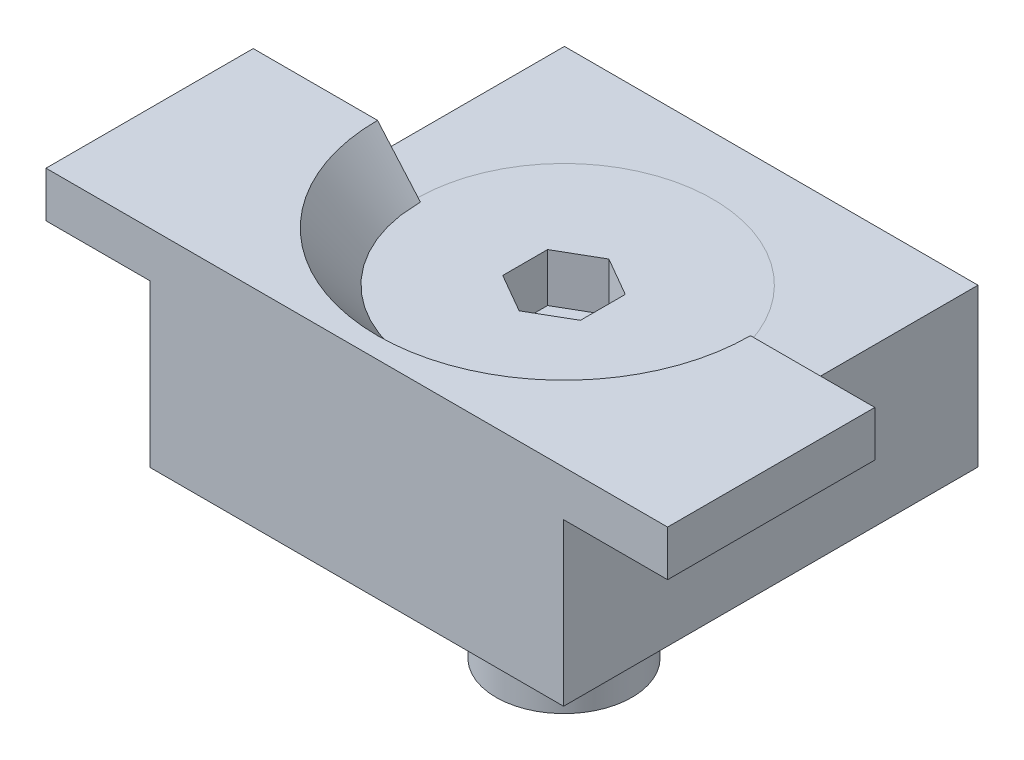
ISO-10303-21;
HEADER;
FILE_DESCRIPTION(('STEP AP214'),'2;1');
FILE_NAME('part.step','',(''),(''),'','','');
FILE_SCHEMA(('AUTOMOTIVE_DESIGN { 1 0 10303 214 1 1 1 1 }'));
ENDSEC;
DATA;
#1=APPLICATION_CONTEXT('core data for automotive mechanical design processes');
#2=APPLICATION_PROTOCOL_DEFINITION('international standard','automotive_design',2000,#1);
#3=PRODUCT_CONTEXT('',#1,'mechanical');
#4=PRODUCT('Part','Part','',(#3));
#5=PRODUCT_RELATED_PRODUCT_CATEGORY('part','',(#4));
#6=PRODUCT_DEFINITION_FORMATION('','',#4);
#7=PRODUCT_DEFINITION_CONTEXT('part definition',#1,'design');
#8=PRODUCT_DEFINITION('design','',#6,#7);
#9=PRODUCT_DEFINITION_SHAPE('','',#8);
#10=(LENGTH_UNIT() NAMED_UNIT(*) SI_UNIT(.MILLI.,.METRE.));
#11=(NAMED_UNIT(*) PLANE_ANGLE_UNIT() SI_UNIT($,.RADIAN.));
#12=(NAMED_UNIT(*) SI_UNIT($,.STERADIAN.) SOLID_ANGLE_UNIT());
#13=UNCERTAINTY_MEASURE_WITH_UNIT(LENGTH_MEASURE(1.E-05),#10,'distance_accuracy_value','');
#14=(GEOMETRIC_REPRESENTATION_CONTEXT(3) GLOBAL_UNCERTAINTY_ASSIGNED_CONTEXT((#13)) GLOBAL_UNIT_ASSIGNED_CONTEXT((#10,
#11,#12)) REPRESENTATION_CONTEXT('',''));
#15=CARTESIAN_POINT('',(0.,0.,0.));
#16=DIRECTION('',(0.,0.,1.));
#17=DIRECTION('',(1.,0.,0.));
#18=AXIS2_PLACEMENT_3D('',#15,#16,#17);
#19=CARTESIAN_POINT('',(9.52499999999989,30.2387,6.35000000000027));
#20=DIRECTION('',(0.,0.999999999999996,0.));
#21=DIRECTION('',(0.,0.,0.999999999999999));
#22=AXIS2_PLACEMENT_3D('',#19,#20,#21);
#23=CYLINDRICAL_SURFACE('',#22,2.08280000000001);
#24=CARTESIAN_POINT('',(9.52499999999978,-5.06729999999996,6.35000000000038));
#25=DIRECTION('',(0.,0.999999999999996,0.));
#26=DIRECTION('',(0.,0.,0.999999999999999));
#27=AXIS2_PLACEMENT_3D('',#24,#25,#26);
#28=CIRCLE('',#27,2.08280000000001);
#29=CARTESIAN_POINT('',(9.52499999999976,-5.06729999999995,8.43280000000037));
#30=VERTEX_POINT('',#29);
#31=EDGE_CURVE('P0_E11',#30,#30,#28,.F.);
#32=CARTESIAN_POINT('',(9.52499999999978,1.98981263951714,6.35000000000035));
#33=DIRECTION('',(0.,0.999999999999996,0.));
#34=DIRECTION('',(0.,0.,0.999999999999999));
#35=AXIS2_PLACEMENT_3D('',#32,#33,#34);
#36=CIRCLE('',#35,2.0828);
#37=CARTESIAN_POINT('',(9.52499999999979,1.98981263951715,8.43280000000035));
#38=VERTEX_POINT('',#37);
#39=EDGE_CURVE('P0_E119',#38,#38,#36,.T.);
#40=CARTESIAN_POINT('',(9.52499999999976,-5.06729999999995,8.43280000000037));
#41=CARTESIAN_POINT('',(9.52499999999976,-4.99378841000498,8.43280000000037));
#42=CARTESIAN_POINT('',(9.52499999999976,-4.92027682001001,8.43280000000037));
#43=CARTESIAN_POINT('',(9.52499999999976,-4.77325364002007,8.43280000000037));
#44=CARTESIAN_POINT('',(9.52499999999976,-4.6997420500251,8.43280000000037));
#45=CARTESIAN_POINT('',(9.52499999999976,-4.55271887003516,8.43280000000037));
#46=CARTESIAN_POINT('',(9.52499999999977,-4.47920728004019,8.43280000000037));
#47=CARTESIAN_POINT('',(9.52499999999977,-4.33218410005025,8.43280000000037));
#48=CARTESIAN_POINT('',(9.52499999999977,-4.25867251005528,8.43280000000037));
#49=CARTESIAN_POINT('',(9.52499999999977,-4.11164933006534,8.43280000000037));
#50=CARTESIAN_POINT('',(9.52499999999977,-4.03813774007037,8.43280000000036));
#51=CARTESIAN_POINT('',(9.52499999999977,-3.89111456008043,8.43280000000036));
#52=CARTESIAN_POINT('',(9.52499999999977,-3.81760297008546,8.43280000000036));
#53=CARTESIAN_POINT('',(9.52499999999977,-3.67057979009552,8.43280000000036));
#54=CARTESIAN_POINT('',(9.52499999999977,-3.59706820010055,8.43280000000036));
#55=CARTESIAN_POINT('',(9.52499999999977,-3.45004502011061,8.43280000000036));
#56=CARTESIAN_POINT('',(9.52499999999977,-3.37653343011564,8.43280000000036));
#57=CARTESIAN_POINT('',(9.52499999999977,-3.22951025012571,8.43280000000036));
#58=CARTESIAN_POINT('',(9.52499999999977,-3.15599866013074,8.43280000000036));
#59=CARTESIAN_POINT('',(9.52499999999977,-3.0089754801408,8.43280000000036));
#60=CARTESIAN_POINT('',(9.52499999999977,-2.93546389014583,8.43280000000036));
#61=CARTESIAN_POINT('',(9.52499999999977,-2.78844071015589,8.43280000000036));
#62=CARTESIAN_POINT('',(9.52499999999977,-2.71492912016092,8.43280000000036));
#63=CARTESIAN_POINT('',(9.52499999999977,-2.56790594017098,8.43280000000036));
#64=CARTESIAN_POINT('',(9.52499999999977,-2.49439435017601,8.43280000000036));
#65=CARTESIAN_POINT('',(9.52499999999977,-2.34737117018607,8.43280000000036));
#66=CARTESIAN_POINT('',(9.52499999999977,-2.2738595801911,8.43280000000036));
#67=CARTESIAN_POINT('',(9.52499999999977,-2.12683640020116,8.43280000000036));
#68=CARTESIAN_POINT('',(9.52499999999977,-2.05332481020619,8.43280000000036));
#69=CARTESIAN_POINT('',(9.52499999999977,-1.90630163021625,8.43280000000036));
#70=CARTESIAN_POINT('',(9.52499999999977,-1.83279004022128,8.43280000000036));
#71=CARTESIAN_POINT('',(9.52499999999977,-1.68576686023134,8.43280000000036));
#72=CARTESIAN_POINT('',(9.52499999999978,-1.61225527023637,8.43280000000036));
#73=CARTESIAN_POINT('',(9.52499999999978,-1.46523209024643,8.43280000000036));
#74=CARTESIAN_POINT('',(9.52499999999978,-1.39172050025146,8.43280000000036));
#75=CARTESIAN_POINT('',(9.52499999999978,-1.24469732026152,8.43280000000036));
#76=CARTESIAN_POINT('',(9.52499999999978,-1.17118573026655,8.43280000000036));
#77=CARTESIAN_POINT('',(9.52499999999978,-1.02416255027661,8.43280000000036));
#78=CARTESIAN_POINT('',(9.52499999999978,-0.950650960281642,8.43280000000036));
#79=CARTESIAN_POINT('',(9.52499999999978,-0.803627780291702,8.43280000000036));
#80=CARTESIAN_POINT('',(9.52499999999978,-0.730116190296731,8.43280000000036));
#81=CARTESIAN_POINT('',(9.52499999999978,-0.583093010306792,8.43280000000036));
#82=CARTESIAN_POINT('',(9.52499999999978,-0.509581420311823,8.43280000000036));
#83=CARTESIAN_POINT('',(9.52499999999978,-0.362558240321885,8.43280000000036));
#84=CARTESIAN_POINT('',(9.52499999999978,-0.289046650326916,8.43280000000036));
#85=CARTESIAN_POINT('',(9.52499999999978,-0.142023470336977,8.43280000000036));
#86=CARTESIAN_POINT('',(9.52499999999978,-0.0685118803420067,8.43280000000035));
#87=CARTESIAN_POINT('',(9.52499999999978,0.0785112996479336,8.43280000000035));
#88=CARTESIAN_POINT('',(9.52499999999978,0.152022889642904,8.43280000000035));
#89=CARTESIAN_POINT('',(9.52499999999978,0.299046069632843,8.43280000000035));
#90=CARTESIAN_POINT('',(9.52499999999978,0.372557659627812,8.43280000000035));
#91=CARTESIAN_POINT('',(9.52499999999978,0.519580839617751,8.43280000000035));
#92=CARTESIAN_POINT('',(9.52499999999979,0.593092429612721,8.43280000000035));
#93=CARTESIAN_POINT('',(9.52499999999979,0.740115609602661,8.43280000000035));
#94=CARTESIAN_POINT('',(9.52499999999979,0.81362719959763,8.43280000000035));
#95=CARTESIAN_POINT('',(9.52499999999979,0.960650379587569,8.43280000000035));
#96=CARTESIAN_POINT('',(9.52499999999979,1.03416196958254,8.43280000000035));
#97=CARTESIAN_POINT('',(9.52499999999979,1.18118514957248,8.43280000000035));
#98=CARTESIAN_POINT('',(9.52499999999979,1.25469673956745,8.43280000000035));
#99=CARTESIAN_POINT('',(9.52499999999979,1.40171991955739,8.43280000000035));
#100=CARTESIAN_POINT('',(9.52499999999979,1.47523150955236,8.43280000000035));
#101=CARTESIAN_POINT('',(9.52499999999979,1.6222546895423,8.43280000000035));
#102=CARTESIAN_POINT('',(9.52499999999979,1.69576627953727,8.43280000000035));
#103=CARTESIAN_POINT('',(9.52499999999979,1.84278945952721,8.43280000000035));
#104=CARTESIAN_POINT('',(9.52499999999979,1.91630104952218,8.43280000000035));
#105=CARTESIAN_POINT('',(9.52499999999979,1.98981263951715,8.43280000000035));
#106=B_SPLINE_CURVE_WITH_KNOTS('',3,(#40,#41,#42,#43,#44,#45,#46,#47,#48,#49,#50,#51,#52,#53,
#54,#55,#56,#57,#58,#59,#60,#61,#62,#63,#64,#65,#66,#67,#68,#69,#70,#71,#72,#73,#74,#75,#76,#77,
#78,#79,#80,#81,#82,#83,#84,#85,#86,#87,#88,#89,#90,#91,#92,#93,#94,#95,#96,#97,#98,#99,#100,
#101,#102,#103,#104,#105),.UNSPECIFIED.,.F.,.F.,(4,2,2,2,2,2,2,2,2,2,2,2,2,2,2,2,2,2,2,2,2,2,2,
2,2,2,2,2,2,2,2,2,4),(0.,0.220534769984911,0.441069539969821,0.661604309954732,
0.882139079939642,1.10267384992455,1.32320861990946,1.54374338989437,1.76427815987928,
1.98481292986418,2.20534769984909,2.425882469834,2.64641723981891,2.86695200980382,
3.08748677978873,3.30802154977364,3.52855631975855,3.74909108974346,3.96962585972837,
4.19016062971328,4.41069539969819,4.6312301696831,4.851764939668,5.07229970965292,
5.29283447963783,5.51336924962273,5.73390401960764,5.95443878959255,6.17497355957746,
6.39550832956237,6.61604309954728,6.83657786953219,7.0571126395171),.UNSPECIFIED.);
#107=EDGE_CURVE('P0_BSEAM16',#30,#38,#106,.T.);
#108=ORIENTED_EDGE('',*,*,#31,.F.);
#109=ORIENTED_EDGE('',*,*,#39,.F.);
#110=ORIENTED_EDGE('',*,*,#107,.T.);
#111=ORIENTED_EDGE('',*,*,#107,.F.);
#112=EDGE_LOOP('',(#108,#110,#109,#111));
#113=FACE_BOUND('',#112,.T.);
#114=ADVANCED_FACE('P0_F16',(#113),#23,.T.);
#115=CARTESIAN_POINT('',(9.52499999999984,4.83870000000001,6.35000000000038));
#116=DIRECTION('',(0.,0.999999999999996,0.));
#117=DIRECTION('',(0.,0.,0.999999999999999));
#118=AXIS2_PLACEMENT_3D('',#115,#116,#117);
#119=PLANE('',#118);
#120=DIRECTION('',(0.,0.,0.999999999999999));
#121=VECTOR('',#120,1.);
#122=CARTESIAN_POINT('',(8.33437499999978,4.83869999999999,5.6625923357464));
#123=LINE('',#122,#121);
#124=CARTESIAN_POINT('',(8.33437499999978,4.83869999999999,5.6625923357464));
#125=VERTEX_POINT('',#124);
#126=CARTESIAN_POINT('',(8.33437499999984,4.83870000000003,7.03740766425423));
#127=VERTEX_POINT('',#126);
#128=EDGE_CURVE('P0_E31',#125,#127,#123,.T.);
#129=ORIENTED_EDGE('',*,*,#128,.F.);
#130=DIRECTION('',(-0.86602540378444,0.,0.499999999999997));
#131=VECTOR('',#130,1.);
#132=CARTESIAN_POINT('',(9.52499999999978,4.83869999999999,4.97518467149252));
#133=LINE('',#132,#131);
#134=CARTESIAN_POINT('',(9.52499999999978,4.83869999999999,4.97518467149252));
#135=VERTEX_POINT('',#134);
#136=EDGE_CURVE('P0_E115',#135,#125,#133,.T.);
#137=ORIENTED_EDGE('',*,*,#136,.F.);
#138=DIRECTION('',(0.866025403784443,0.,0.500000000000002));
#139=VECTOR('',#138,1.);
#140=CARTESIAN_POINT('',(9.52499999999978,4.83869999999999,4.97518467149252));
#141=LINE('',#140,#139);
#142=CARTESIAN_POINT('',(10.7156249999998,4.83869999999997,5.6625923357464));
#143=VERTEX_POINT('',#142);
#144=EDGE_CURVE('P0_E113',#135,#143,#141,.T.);
#145=ORIENTED_EDGE('',*,*,#144,.T.);
#146=DIRECTION('',(0.,0.,0.999999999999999));
#147=VECTOR('',#146,1.);
#148=CARTESIAN_POINT('',(10.7156249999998,4.83869999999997,5.6625923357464));
#149=LINE('',#148,#147);
#150=CARTESIAN_POINT('',(10.7156249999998,4.83870000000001,7.03740766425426));
#151=VERTEX_POINT('',#150);
#152=EDGE_CURVE('P0_E90',#143,#151,#149,.T.);
#153=ORIENTED_EDGE('',*,*,#152,.T.);
#154=DIRECTION('',(0.866025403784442,0.,-0.499999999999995));
#155=VECTOR('',#154,1.);
#156=CARTESIAN_POINT('',(9.52499999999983,4.83870000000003,7.72481532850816));
#157=LINE('',#156,#155);
#158=CARTESIAN_POINT('',(9.52499999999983,4.83870000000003,7.72481532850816));
#159=VERTEX_POINT('',#158);
#160=EDGE_CURVE('P0_E109',#159,#151,#157,.T.);
#161=ORIENTED_EDGE('',*,*,#160,.F.);
#162=DIRECTION('',(-0.866025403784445,0.,-0.499999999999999));
#163=VECTOR('',#162,1.);
#164=CARTESIAN_POINT('',(9.52499999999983,4.83870000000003,7.72481532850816));
#165=LINE('',#164,#163);
#166=EDGE_CURVE('P0_E106',#159,#127,#165,.T.);
#167=ORIENTED_EDGE('',*,*,#166,.T.);
#168=EDGE_LOOP('',(#129,#137,#145,#153,#161,#167));
#169=FACE_BOUND('',#168,.T.);
#170=CARTESIAN_POINT('',(9.52499999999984,4.83870000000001,6.35000000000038));
#171=DIRECTION('',(0.,0.999999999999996,0.));
#172=DIRECTION('',(0.,0.,0.999999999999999));
#173=AXIS2_PLACEMENT_3D('',#170,#171,#172);
#174=CIRCLE('',#173,4.5593);
#175=CARTESIAN_POINT('',(9.52499999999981,4.83870000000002,10.9093000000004));
#176=VERTEX_POINT('',#175);
#177=EDGE_CURVE('P0_E24',#176,#176,#174,.T.);
#178=ORIENTED_EDGE('',*,*,#177,.T.);
#179=EDGE_LOOP('',(#178));
#180=FACE_BOUND('',#179,.T.);
#181=ADVANCED_FACE('P0_F18',(#169,#180),#119,.T.);
#182=CARTESIAN_POINT('',(9.52499999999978,1.98981263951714,6.35000000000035));
#183=DIRECTION('',(0.,0.999999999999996,0.));
#184=DIRECTION('',(0.,0.,0.999999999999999));
#185=AXIS2_PLACEMENT_3D('',#182,#183,#184);
#186=CONICAL_SURFACE('',#185,2.0828,0.715584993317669);
#187=CARTESIAN_POINT('',(9.52499999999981,4.83870000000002,10.9093000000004));
#188=CARTESIAN_POINT('',(9.52499999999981,4.80902408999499,10.8835031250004));
#189=CARTESIAN_POINT('',(9.52499999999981,4.77934817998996,10.8577062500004));
#190=CARTESIAN_POINT('',(9.52499999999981,4.7199963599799,10.8061125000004));
#191=CARTESIAN_POINT('',(9.5249999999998,4.69032044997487,10.7803156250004));
#192=CARTESIAN_POINT('',(9.5249999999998,4.63096862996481,10.7287218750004));
#193=CARTESIAN_POINT('',(9.5249999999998,4.60129271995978,10.7029250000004));
#194=CARTESIAN_POINT('',(9.5249999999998,4.54194089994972,10.6513312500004));
#195=CARTESIAN_POINT('',(9.5249999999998,4.51226498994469,10.6255343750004));
#196=CARTESIAN_POINT('',(9.5249999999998,4.45291316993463,10.5739406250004));
#197=CARTESIAN_POINT('',(9.5249999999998,4.4232372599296,10.5481437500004));
#198=CARTESIAN_POINT('',(9.5249999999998,4.36388543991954,10.4965500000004));
#199=CARTESIAN_POINT('',(9.5249999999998,4.33420952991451,10.4707531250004));
#200=CARTESIAN_POINT('',(9.5249999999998,4.27485770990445,10.4191593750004));
#201=CARTESIAN_POINT('',(9.5249999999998,4.24518179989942,10.3933625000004));
#202=CARTESIAN_POINT('',(9.5249999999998,4.18582997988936,10.3417687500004));
#203=CARTESIAN_POINT('',(9.5249999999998,4.15615406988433,10.3159718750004));
#204=CARTESIAN_POINT('',(9.5249999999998,4.09680224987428,10.2643781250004));
#205=CARTESIAN_POINT('',(9.5249999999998,4.06712633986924,10.2385812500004));
#206=CARTESIAN_POINT('',(9.5249999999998,4.00777451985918,10.1869875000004));
#207=CARTESIAN_POINT('',(9.5249999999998,3.97809860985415,10.1611906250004));
#208=CARTESIAN_POINT('',(9.5249999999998,3.9187467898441,10.1095968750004));
#209=CARTESIAN_POINT('',(9.5249999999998,3.88907087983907,10.0838000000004));
#210=CARTESIAN_POINT('',(9.5249999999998,3.82971905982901,10.0322062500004));
#211=CARTESIAN_POINT('',(9.5249999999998,3.80004314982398,10.0064093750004));
#212=CARTESIAN_POINT('',(9.5249999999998,3.74069132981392,9.95481562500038));
#213=CARTESIAN_POINT('',(9.5249999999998,3.71101541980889,9.92901875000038));
#214=CARTESIAN_POINT('',(9.5249999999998,3.65166359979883,9.87742500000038));
#215=CARTESIAN_POINT('',(9.5249999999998,3.6219876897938,9.85162812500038));
#216=CARTESIAN_POINT('',(9.5249999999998,3.56263586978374,9.80003437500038));
#217=CARTESIAN_POINT('',(9.5249999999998,3.53295995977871,9.77423750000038));
#218=CARTESIAN_POINT('',(9.5249999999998,3.47360813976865,9.72264375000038));
#219=CARTESIAN_POINT('',(9.5249999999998,3.44393222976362,9.69684687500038));
#220=CARTESIAN_POINT('',(9.5249999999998,3.38458040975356,9.64525312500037));
#221=CARTESIAN_POINT('',(9.5249999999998,3.35490449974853,9.61945625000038));
#222=CARTESIAN_POINT('',(9.5249999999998,3.29555267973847,9.56786250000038));
#223=CARTESIAN_POINT('',(9.5249999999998,3.26587676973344,9.54206562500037));
#224=CARTESIAN_POINT('',(9.5249999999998,3.20652494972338,9.49047187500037));
#225=CARTESIAN_POINT('',(9.5249999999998,3.17684903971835,9.46467500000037));
#226=CARTESIAN_POINT('',(9.5249999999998,3.11749721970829,9.41308125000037));
#227=CARTESIAN_POINT('',(9.52499999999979,3.08782130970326,9.38728437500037));
#228=CARTESIAN_POINT('',(9.52499999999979,3.0284694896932,9.33569062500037));
#229=CARTESIAN_POINT('',(9.52499999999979,2.99879357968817,9.30989375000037));
#230=CARTESIAN_POINT('',(9.52499999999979,2.93944175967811,9.25830000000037));
#231=CARTESIAN_POINT('',(9.52499999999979,2.90976584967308,9.23250312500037));
#232=CARTESIAN_POINT('',(9.52499999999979,2.85041402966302,9.18090937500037));
#233=CARTESIAN_POINT('',(9.52499999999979,2.82073811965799,9.15511250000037));
#234=CARTESIAN_POINT('',(9.52499999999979,2.76138629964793,9.10351875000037));
#235=CARTESIAN_POINT('',(9.52499999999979,2.7317103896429,9.07772187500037));
#236=CARTESIAN_POINT('',(9.52499999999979,2.67235856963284,9.02612812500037));
#237=CARTESIAN_POINT('',(9.52499999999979,2.64268265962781,9.00033125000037));
#238=CARTESIAN_POINT('',(9.52499999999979,2.58333083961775,8.94873750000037));
#239=CARTESIAN_POINT('',(9.52499999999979,2.55365492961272,8.92294062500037));
#240=CARTESIAN_POINT('',(9.52499999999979,2.49430310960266,8.87134687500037));
#241=CARTESIAN_POINT('',(9.52499999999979,2.46462719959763,8.84555000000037));
#242=CARTESIAN_POINT('',(9.52499999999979,2.40527537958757,8.79395625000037));
#243=CARTESIAN_POINT('',(9.52499999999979,2.37559946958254,8.76815937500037));
#244=CARTESIAN_POINT('',(9.52499999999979,2.31624764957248,8.71656562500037));
#245=CARTESIAN_POINT('',(9.52499999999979,2.28657173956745,8.69076875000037));
#246=CARTESIAN_POINT('',(9.52499999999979,2.22721991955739,8.63917500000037));
#247=CARTESIAN_POINT('',(9.52499999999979,2.19754400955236,8.61337812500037));
#248=CARTESIAN_POINT('',(9.52499999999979,2.1381921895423,8.56178437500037));
#249=CARTESIAN_POINT('',(9.52499999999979,2.10851627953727,8.53598750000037));
#250=CARTESIAN_POINT('',(9.52499999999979,2.04916445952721,8.48439375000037));
#251=CARTESIAN_POINT('',(9.52499999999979,2.01948854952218,8.45859687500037));
#252=CARTESIAN_POINT('',(9.52499999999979,1.98981263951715,8.43280000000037));
#253=B_SPLINE_CURVE_WITH_KNOTS('',3,(#187,#188,#189,#190,#191,#192,#193,#194,#195,#196,#197,
#198,#199,#200,#201,#202,#203,#204,#205,#206,#207,#208,#209,#210,#211,#212,#213,#214,#215,#216,
#217,#218,#219,#220,#221,#222,#223,#224,#225,#226,#227,#228,#229,#230,#231,#232,#233,#234,#235,
#236,#237,#238,#239,#240,#241,#242,#243,#244,#245,#246,#247,#248,#249,#250,#251,#252),
.UNSPECIFIED.,.F.,.F.,(4,2,2,2,2,2,2,2,2,2,2,2,2,2,2,2,2,2,2,2,2,2,2,2,2,2,2,2,2,2,2,2,4),(0.,
0.117962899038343,0.235925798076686,0.353888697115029,0.471851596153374,0.589814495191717,
0.707777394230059,0.825740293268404,0.943703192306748,1.06166609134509,1.17962899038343,
1.29759188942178,1.41555478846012,1.53351768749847,1.65148058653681,1.76944348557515,
1.8874063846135,2.00536928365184,2.12333218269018,2.24129508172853,2.35925798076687,
2.47722087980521,2.59518377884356,2.7131466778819,2.83110957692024,2.94907247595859,
3.06703537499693,3.18499827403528,3.30296117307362,3.42092407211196,3.5388869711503,
3.65684987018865,3.77481276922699),.UNSPECIFIED.);
#254=EDGE_CURVE('P0_BSEAM130',#176,#38,#253,.T.);
#255=ORIENTED_EDGE('',*,*,#177,.F.);
#256=ORIENTED_EDGE('',*,*,#39,.T.);
#257=ORIENTED_EDGE('',*,*,#254,.T.);
#258=ORIENTED_EDGE('',*,*,#254,.F.);
#259=EDGE_LOOP('',(#255,#257,#256,#258));
#260=FACE_BOUND('',#259,.T.);
#261=ADVANCED_FACE('P0_F130',(#260),#186,.T.);
#262=CARTESIAN_POINT('',(8.33437499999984,3.35280000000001,5.6625923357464));
#263=DIRECTION('',(-1.,0.,0.));
#264=DIRECTION('',(0.,0.,0.999999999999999));
#265=AXIS2_PLACEMENT_3D('',#262,#263,#264);
#266=PLANE('',#265);
#267=ORIENTED_EDGE('',*,*,#128,.T.);
#268=DIRECTION('',(0.,0.999999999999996,0.));
#269=VECTOR('',#268,1.);
#270=CARTESIAN_POINT('',(8.33437499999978,3.35280000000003,7.0374076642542));
#271=LINE('',#270,#269);
#272=CARTESIAN_POINT('',(8.33437499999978,3.35280000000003,7.0374076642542));
#273=VERTEX_POINT('',#272);
#274=EDGE_CURVE('P0_E104',#273,#127,#271,.T.);
#275=ORIENTED_EDGE('',*,*,#274,.F.);
#276=DIRECTION('',(0.,0.,0.999999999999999));
#277=VECTOR('',#276,1.);
#278=CARTESIAN_POINT('',(8.33437499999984,3.35280000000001,5.6625923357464));
#279=LINE('',#278,#277);
#280=CARTESIAN_POINT('',(8.33437499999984,3.35280000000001,5.6625923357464));
#281=VERTEX_POINT('',#280);
#282=EDGE_CURVE('P0_E117',#281,#273,#279,.T.);
#283=ORIENTED_EDGE('',*,*,#282,.F.);
#284=DIRECTION('',(0.,0.999999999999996,0.));
#285=VECTOR('',#284,1.);
#286=CARTESIAN_POINT('',(8.33437499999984,3.35280000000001,5.6625923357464));
#287=LINE('',#286,#285);
#288=EDGE_CURVE('P0_E39',#281,#125,#287,.T.);
#289=ORIENTED_EDGE('',*,*,#288,.T.);
#290=EDGE_LOOP('',(#267,#275,#283,#289));
#291=FACE_BOUND('',#290,.T.);
#292=ADVANCED_FACE('P0_F133',(#291),#266,.F.);
#293=CARTESIAN_POINT('',(9.52499999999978,3.35280000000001,4.97518467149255));
#294=DIRECTION('',(-0.500000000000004,0.,-0.866025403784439));
#295=DIRECTION('',(-0.86602540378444,0.,0.499999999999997));
#296=AXIS2_PLACEMENT_3D('',#293,#294,#295);
#297=PLANE('',#296);
#298=ORIENTED_EDGE('',*,*,#136,.T.);
#299=ORIENTED_EDGE('',*,*,#288,.F.);
#300=DIRECTION('',(-0.86602540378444,0.,0.499999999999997));
#301=VECTOR('',#300,1.);
#302=CARTESIAN_POINT('',(9.52499999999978,3.35280000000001,4.97518467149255));
#303=LINE('',#302,#301);
#304=CARTESIAN_POINT('',(9.52499999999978,3.35280000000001,4.97518467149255));
#305=VERTEX_POINT('',#304);
#306=EDGE_CURVE('P0_E83',#305,#281,#303,.T.);
#307=ORIENTED_EDGE('',*,*,#306,.F.);
#308=DIRECTION('',(0.,0.999999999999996,0.));
#309=VECTOR('',#308,1.);
#310=CARTESIAN_POINT('',(9.52499999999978,3.35280000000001,4.97518467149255));
#311=LINE('',#310,#309);
#312=EDGE_CURVE('P0_E79',#305,#135,#311,.T.);
#313=ORIENTED_EDGE('',*,*,#312,.T.);
#314=EDGE_LOOP('',(#298,#299,#307,#313));
#315=FACE_BOUND('',#314,.T.);
#316=ADVANCED_FACE('P0_F148',(#315),#297,.F.);
#317=CARTESIAN_POINT('',(9.52499999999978,3.35280000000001,4.97518467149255));
#318=DIRECTION('',(-0.499999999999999,0.,0.866025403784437));
#319=DIRECTION('',(0.866025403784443,0.,0.500000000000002));
#320=AXIS2_PLACEMENT_3D('',#317,#318,#319);
#321=PLANE('',#320);
#322=ORIENTED_EDGE('',*,*,#144,.F.);
#323=ORIENTED_EDGE('',*,*,#312,.F.);
#324=DIRECTION('',(0.866025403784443,0.,0.500000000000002));
#325=VECTOR('',#324,1.);
#326=CARTESIAN_POINT('',(9.52499999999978,3.35280000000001,4.97518467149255));
#327=LINE('',#326,#325);
#328=CARTESIAN_POINT('',(10.7156249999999,3.35280000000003,5.66259233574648));
#329=VERTEX_POINT('',#328);
#330=EDGE_CURVE('P0_E73',#305,#329,#327,.T.);
#331=ORIENTED_EDGE('',*,*,#330,.T.);
#332=DIRECTION('',(0.,0.999999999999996,0.));
#333=VECTOR('',#332,1.);
#334=CARTESIAN_POINT('',(10.7156249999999,3.35280000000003,5.66259233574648));
#335=LINE('',#334,#333);
#336=EDGE_CURVE('P0_E77',#329,#143,#335,.T.);
#337=ORIENTED_EDGE('',*,*,#336,.T.);
#338=EDGE_LOOP('',(#322,#323,#331,#337));
#339=FACE_BOUND('',#338,.T.);
#340=ADVANCED_FACE('P0_F76',(#339),#321,.T.);
#341=CARTESIAN_POINT('',(10.7156249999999,3.35280000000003,5.66259233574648));
#342=DIRECTION('',(-1.,0.,0.));
#343=DIRECTION('',(0.,0.,0.999999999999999));
#344=AXIS2_PLACEMENT_3D('',#341,#342,#343);
#345=PLANE('',#344);
#346=ORIENTED_EDGE('',*,*,#152,.F.);
#347=ORIENTED_EDGE('',*,*,#336,.F.);
#348=DIRECTION('',(0.,0.,0.999999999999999));
#349=VECTOR('',#348,1.);
#350=CARTESIAN_POINT('',(10.7156249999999,3.35280000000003,5.66259233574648));
#351=LINE('',#350,#349);
#352=CARTESIAN_POINT('',(10.7156249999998,3.35280000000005,7.03740766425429));
#353=VERTEX_POINT('',#352);
#354=EDGE_CURVE('P0_E84',#329,#353,#351,.T.);
#355=ORIENTED_EDGE('',*,*,#354,.T.);
#356=DIRECTION('',(0.,0.999999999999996,0.));
#357=VECTOR('',#356,1.);
#358=CARTESIAN_POINT('',(10.7156249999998,3.35280000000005,7.03740766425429));
#359=LINE('',#358,#357);
#360=EDGE_CURVE('P0_E92',#353,#151,#359,.T.);
#361=ORIENTED_EDGE('',*,*,#360,.T.);
#362=EDGE_LOOP('',(#346,#347,#355,#361));
#363=FACE_BOUND('',#362,.T.);
#364=ADVANCED_FACE('P0_F87',(#363),#345,.T.);
#365=CARTESIAN_POINT('',(9.52499999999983,3.35279999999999,7.72481532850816));
#366=DIRECTION('',(0.500000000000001,0.,0.866025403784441));
#367=DIRECTION('',(0.866025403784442,0.,-0.499999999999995));
#368=AXIS2_PLACEMENT_3D('',#365,#366,#367);
#369=PLANE('',#368);
#370=ORIENTED_EDGE('',*,*,#160,.T.);
#371=ORIENTED_EDGE('',*,*,#360,.F.);
#372=DIRECTION('',(0.866025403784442,0.,-0.499999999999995));
#373=VECTOR('',#372,1.);
#374=CARTESIAN_POINT('',(9.52499999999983,3.35279999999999,7.72481532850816));
#375=LINE('',#374,#373);
#376=CARTESIAN_POINT('',(9.52499999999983,3.35279999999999,7.72481532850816));
#377=VERTEX_POINT('',#376);
#378=EDGE_CURVE('P0_E98',#377,#353,#375,.T.);
#379=ORIENTED_EDGE('',*,*,#378,.F.);
#380=DIRECTION('',(0.,0.999999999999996,0.));
#381=VECTOR('',#380,1.);
#382=CARTESIAN_POINT('',(9.52499999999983,3.35279999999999,7.72481532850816));
#383=LINE('',#382,#381);
#384=EDGE_CURVE('P0_E122',#377,#159,#383,.T.);
#385=ORIENTED_EDGE('',*,*,#384,.T.);
#386=EDGE_LOOP('',(#370,#371,#379,#385));
#387=FACE_BOUND('',#386,.T.);
#388=ADVANCED_FACE('P0_F152',(#387),#369,.F.);
#389=CARTESIAN_POINT('',(9.52499999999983,3.35279999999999,7.72481532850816));
#390=DIRECTION('',(0.499999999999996,0.,-0.866025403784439));
#391=DIRECTION('',(-0.866025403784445,0.,-0.499999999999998));
#392=AXIS2_PLACEMENT_3D('',#389,#390,#391);
#393=PLANE('',#392);
#394=ORIENTED_EDGE('',*,*,#166,.F.);
#395=ORIENTED_EDGE('',*,*,#384,.F.);
#396=DIRECTION('',(-0.866025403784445,0.,-0.499999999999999));
#397=VECTOR('',#396,1.);
#398=CARTESIAN_POINT('',(9.52499999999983,3.35279999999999,7.72481532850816));
#399=LINE('',#398,#397);
#400=EDGE_CURVE('P0_E65',#377,#273,#399,.T.);
#401=ORIENTED_EDGE('',*,*,#400,.T.);
#402=ORIENTED_EDGE('',*,*,#274,.T.);
#403=EDGE_LOOP('',(#394,#395,#401,#402));
#404=FACE_BOUND('',#403,.T.);
#405=ADVANCED_FACE('P0_F149',(#404),#393,.T.);
#406=CARTESIAN_POINT('',(8.33437499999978,3.35280000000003,7.0374076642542));
#407=DIRECTION('',(0.,-0.999999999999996,0.));
#408=DIRECTION('',(0.,0.,-0.999999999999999));
#409=AXIS2_PLACEMENT_3D('',#406,#407,#408);
#410=PLANE('',#409);
#411=ORIENTED_EDGE('',*,*,#282,.T.);
#412=ORIENTED_EDGE('',*,*,#400,.F.);
#413=ORIENTED_EDGE('',*,*,#378,.T.);
#414=ORIENTED_EDGE('',*,*,#354,.F.);
#415=ORIENTED_EDGE('',*,*,#330,.F.);
#416=ORIENTED_EDGE('',*,*,#306,.T.);
#417=EDGE_LOOP('',(#411,#412,#413,#414,#415,#416));
#418=FACE_BOUND('',#417,.T.);
#419=ADVANCED_FACE('P0_F96',(#418),#410,.F.);
#420=CARTESIAN_POINT('',(20.9018056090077,-5.06729999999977,-51.4834930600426));
#421=DIRECTION('',(0.,0.999999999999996,0.));
#422=DIRECTION('',(0.,0.,0.999999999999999));
#423=AXIS2_PLACEMENT_3D('',#420,#421,#422);
#424=PLANE('',#423);
#425=ORIENTED_EDGE('',*,*,#31,.T.);
#426=EDGE_LOOP('',(#425));
#427=FACE_BOUND('',#426,.T.);
#428=ADVANCED_FACE('P0_F164',(#427),#424,.F.);
#429=CLOSED_SHELL('',(#114,#181,#261,#292,#316,#340,#364,#388,#405,#419,#428));
#430=MANIFOLD_SOLID_BREP('P0_B1',#429);
#431=CARTESIAN_POINT('',(0.,6.35,0.));
#432=DIRECTION('',(0.,0.,0.999999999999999));
#433=DIRECTION('',(1.,0.,0.));
#434=AXIS2_PLACEMENT_3D('',#431,#432,#433);
#435=PLANE('',#434);
#436=DIRECTION('',(-1.,0.,0.));
#437=VECTOR('',#436,1.);
#438=CARTESIAN_POINT('',(0.,0.,0.));
#439=LINE('',#438,#437);
#440=CARTESIAN_POINT('',(15.8622999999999,0.,4.71844785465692E-13));
#441=VERTEX_POINT('',#440);
#442=CARTESIAN_POINT('',(3.18769999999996,0.,0.));
#443=VERTEX_POINT('',#442);
#444=EDGE_CURVE('P1_E121',#441,#443,#439,.T.);
#445=ORIENTED_EDGE('',*,*,#444,.T.);
#446=DIRECTION('',(0.,-0.999999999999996,0.));
#447=VECTOR('',#446,1.);
#448=CARTESIAN_POINT('',(3.18769999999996,0.,0.));
#449=LINE('',#448,#447);
#450=CARTESIAN_POINT('',(3.1876999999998,4.82599999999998,0.));
#451=VERTEX_POINT('',#450);
#452=EDGE_CURVE('P1_E104',#451,#443,#449,.T.);
#453=ORIENTED_EDGE('',*,*,#452,.F.);
#454=DIRECTION('',(-1.,0.,0.));
#455=VECTOR('',#454,1.);
#456=CARTESIAN_POINT('',(0.,4.82600000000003,0.));
#457=LINE('',#456,#455);
#458=CARTESIAN_POINT('',(15.8622999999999,4.82600000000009,4.71844785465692E-13));
#459=VERTEX_POINT('',#458);
#460=EDGE_CURVE('P1_E190',#459,#451,#457,.T.);
#461=ORIENTED_EDGE('',*,*,#460,.F.);
#462=DIRECTION('',(0.,0.999999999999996,0.));
#463=VECTOR('',#462,1.);
#464=CARTESIAN_POINT('',(15.8622999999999,0.,4.71844785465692E-13));
#465=LINE('',#464,#463);
#466=EDGE_CURVE('P1_E39',#441,#459,#465,.T.);
#467=ORIENTED_EDGE('',*,*,#466,.F.);
#468=EDGE_LOOP('',(#445,#453,#461,#467));
#469=FACE_BOUND('',#468,.T.);
#470=ADVANCED_FACE('P1_F16',(#469),#435,.F.);
#471=CARTESIAN_POINT('',(19.05,6.35000000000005,12.7000000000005));
#472=DIRECTION('',(-1.,0.,0.));
#473=DIRECTION('',(0.,0.,0.999999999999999));
#474=AXIS2_PLACEMENT_3D('',#471,#472,#473);
#475=PLANE('',#474);
#476=DIRECTION('',(0.,-0.999999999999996,0.));
#477=VECTOR('',#476,1.);
#478=CARTESIAN_POINT('',(19.05,6.35000000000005,12.7000000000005));
#479=LINE('',#478,#477);
#480=CARTESIAN_POINT('',(19.05,6.35000000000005,12.7000000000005));
#481=VERTEX_POINT('',#480);
#482=CARTESIAN_POINT('',(19.05,4.95300000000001,12.7000000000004));
#483=VERTEX_POINT('',#482);
#484=EDGE_CURVE('P1_E136',#481,#483,#479,.T.);
#485=ORIENTED_EDGE('',*,*,#484,.T.);
#486=DIRECTION('',(0.,0.,0.999999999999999));
#487=VECTOR('',#486,1.);
#488=CARTESIAN_POINT('',(19.05,4.95300000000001,12.7000000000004));
#489=LINE('',#488,#487);
#490=CARTESIAN_POINT('',(19.05,4.9530000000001,6.35000000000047));
#491=VERTEX_POINT('',#490);
#492=EDGE_CURVE('P1_E168',#491,#483,#489,.T.);
#493=ORIENTED_EDGE('',*,*,#492,.F.);
#494=DIRECTION('',(0.,0.999999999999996,0.));
#495=VECTOR('',#494,1.);
#496=CARTESIAN_POINT('',(19.0499999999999,4.82600000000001,6.35000000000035));
#497=LINE('',#496,#495);
#498=CARTESIAN_POINT('',(19.0499999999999,6.35000000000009,6.35000000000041));
#499=VERTEX_POINT('',#498);
#500=EDGE_CURVE('P1_E162',#491,#499,#497,.T.);
#501=ORIENTED_EDGE('',*,*,#500,.T.);
#502=DIRECTION('',(0.,0.,-0.999999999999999));
#503=VECTOR('',#502,1.);
#504=CARTESIAN_POINT('',(19.05,6.35000000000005,12.7000000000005));
#505=LINE('',#504,#503);
#506=EDGE_CURVE('P1_E127',#481,#499,#505,.T.);
#507=ORIENTED_EDGE('',*,*,#506,.F.);
#508=EDGE_LOOP('',(#485,#493,#501,#507));
#509=FACE_BOUND('',#508,.T.);
#510=ADVANCED_FACE('P1_F18',(#509),#475,.F.);
#511=CARTESIAN_POINT('',(0.,6.34999999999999,12.7));
#512=DIRECTION('',(1.,0.,0.));
#513=DIRECTION('',(0.,0.,-0.999999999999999));
#514=AXIS2_PLACEMENT_3D('',#511,#512,#513);
#515=PLANE('',#514);
#516=DIRECTION('',(0.,0.999999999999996,0.));
#517=VECTOR('',#516,1.);
#518=CARTESIAN_POINT('',(0.,4.826,6.34999999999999));
#519=LINE('',#518,#517);
#520=CARTESIAN_POINT('',(0.,4.95300000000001,6.34999999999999));
#521=VERTEX_POINT('',#520);
#522=CARTESIAN_POINT('',(0.,6.34999999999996,6.35000000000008));
#523=VERTEX_POINT('',#522);
#524=EDGE_CURVE('P1_E193',#521,#523,#519,.T.);
#525=ORIENTED_EDGE('',*,*,#524,.F.);
#526=DIRECTION('',(0.,0.,-0.999999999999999));
#527=VECTOR('',#526,1.);
#528=CARTESIAN_POINT('',(0.,4.95299999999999,0.));
#529=LINE('',#528,#527);
#530=CARTESIAN_POINT('',(0.,4.95299999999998,12.7));
#531=VERTEX_POINT('',#530);
#532=EDGE_CURVE('P1_E113',#531,#521,#529,.T.);
#533=ORIENTED_EDGE('',*,*,#532,.F.);
#534=DIRECTION('',(0.,-0.999999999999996,0.));
#535=VECTOR('',#534,1.);
#536=CARTESIAN_POINT('',(0.,6.34999999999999,12.7));
#537=LINE('',#536,#535);
#538=CARTESIAN_POINT('',(0.,6.34999999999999,12.7));
#539=VERTEX_POINT('',#538);
#540=EDGE_CURVE('P1_E139',#539,#531,#537,.T.);
#541=ORIENTED_EDGE('',*,*,#540,.F.);
#542=DIRECTION('',(0.,0.,0.999999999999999));
#543=VECTOR('',#542,1.);
#544=CARTESIAN_POINT('',(0.,6.34999999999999,12.7));
#545=LINE('',#544,#543);
#546=EDGE_CURVE('P1_E204',#523,#539,#545,.T.);
#547=ORIENTED_EDGE('',*,*,#546,.F.);
#548=EDGE_LOOP('',(#525,#533,#541,#547));
#549=FACE_BOUND('',#548,.T.);
#550=ADVANCED_FACE('P1_F229',(#549),#515,.F.);
#551=CARTESIAN_POINT('',(0.,6.34999999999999,12.7));
#552=DIRECTION('',(0.,0.,-0.999999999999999));
#553=DIRECTION('',(-1.,0.,0.));
#554=AXIS2_PLACEMENT_3D('',#551,#552,#553);
#555=PLANE('',#554);
#556=ORIENTED_EDGE('',*,*,#540,.T.);
#557=DIRECTION('',(-1.,0.,0.));
#558=VECTOR('',#557,1.);
#559=CARTESIAN_POINT('',(3.18769999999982,4.95299999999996,12.7));
#560=LINE('',#559,#558);
#561=CARTESIAN_POINT('',(3.18769999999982,4.95299999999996,12.7));
#562=VERTEX_POINT('',#561);
#563=EDGE_CURVE('P1_E179',#562,#531,#560,.T.);
#564=ORIENTED_EDGE('',*,*,#563,.F.);
#565=DIRECTION('',(0.,0.999999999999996,0.));
#566=VECTOR('',#565,1.);
#567=CARTESIAN_POINT('',(3.18769999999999,0.,12.7));
#568=LINE('',#567,#566);
#569=CARTESIAN_POINT('',(3.18769999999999,0.,12.7));
#570=VERTEX_POINT('',#569);
#571=EDGE_CURVE('P1_E123',#570,#562,#568,.T.);
#572=ORIENTED_EDGE('',*,*,#571,.F.);
#573=DIRECTION('',(1.,0.,0.));
#574=VECTOR('',#573,1.);
#575=CARTESIAN_POINT('',(0.,0.,12.7));
#576=LINE('',#575,#574);
#577=CARTESIAN_POINT('',(15.8622999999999,0.,12.7000000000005));
#578=VERTEX_POINT('',#577);
#579=EDGE_CURVE('P1_E122',#570,#578,#576,.T.);
#580=ORIENTED_EDGE('',*,*,#579,.T.);
#581=DIRECTION('',(0.,-0.999999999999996,0.));
#582=VECTOR('',#581,1.);
#583=CARTESIAN_POINT('',(15.8622999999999,0.,12.7000000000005));
#584=LINE('',#583,#582);
#585=CARTESIAN_POINT('',(15.8623,4.95300000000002,12.7000000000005));
#586=VERTEX_POINT('',#585);
#587=EDGE_CURVE('P1_E174',#586,#578,#584,.T.);
#588=ORIENTED_EDGE('',*,*,#587,.F.);
#589=DIRECTION('',(1.,0.,0.));
#590=VECTOR('',#589,1.);
#591=CARTESIAN_POINT('',(15.8623,4.95300000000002,12.7000000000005));
#592=LINE('',#591,#590);
#593=EDGE_CURVE('P1_E184',#586,#483,#592,.T.);
#594=ORIENTED_EDGE('',*,*,#593,.T.);
#595=ORIENTED_EDGE('',*,*,#484,.F.);
#596=DIRECTION('',(1.,0.,0.));
#597=VECTOR('',#596,1.);
#598=CARTESIAN_POINT('',(0.,6.34999999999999,12.7));
#599=LINE('',#598,#597);
#600=EDGE_CURVE('P1_E133',#539,#481,#599,.T.);
#601=ORIENTED_EDGE('',*,*,#600,.F.);
#602=EDGE_LOOP('',(#556,#564,#572,#580,#588,#594,#595,#601));
#603=FACE_BOUND('',#602,.T.);
#604=ADVANCED_FACE('P1_F213',(#603),#555,.F.);
#605=CARTESIAN_POINT('',(0.,6.35,0.));
#606=DIRECTION('',(0.,-0.999999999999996,0.));
#607=DIRECTION('',(0.,0.,-0.999999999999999));
#608=AXIS2_PLACEMENT_3D('',#605,#606,#607);
#609=PLANE('',#608);
#610=ORIENTED_EDGE('',*,*,#506,.T.);
#611=DIRECTION('',(1.,0.,0.));
#612=VECTOR('',#611,1.);
#613=CARTESIAN_POINT('',(0.,6.34999999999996,6.35000000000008));
#614=LINE('',#613,#612);
#615=CARTESIAN_POINT('',(15.2399999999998,6.35000000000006,6.35000000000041));
#616=VERTEX_POINT('',#615);
#617=EDGE_CURVE('P1_E187',#616,#499,#614,.T.);
#618=ORIENTED_EDGE('',*,*,#617,.F.);
#619=CARTESIAN_POINT('',(9.52499999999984,6.35000000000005,6.35000000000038));
#620=DIRECTION('',(0.,0.999999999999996,0.));
#621=DIRECTION('',(0.,0.,0.999999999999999));
#622=AXIS2_PLACEMENT_3D('',#619,#620,#621);
#623=CIRCLE('',#622,5.715);
#624=CARTESIAN_POINT('',(3.80999999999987,6.35,6.34999999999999));
#625=VERTEX_POINT('',#624);
#626=EDGE_CURVE('P1_E197',#625,#616,#623,.T.);
#627=ORIENTED_EDGE('',*,*,#626,.F.);
#628=EDGE_CURVE('P1_E194',#523,#625,#614,.T.);
#629=ORIENTED_EDGE('',*,*,#628,.F.);
#630=ORIENTED_EDGE('',*,*,#546,.T.);
#631=ORIENTED_EDGE('',*,*,#600,.T.);
#632=EDGE_LOOP('',(#610,#618,#627,#629,#630,#631));
#633=FACE_BOUND('',#632,.T.);
#634=ADVANCED_FACE('P1_F210',(#633),#609,.F.);
#635=CARTESIAN_POINT('',(0.,0.,0.));
#636=DIRECTION('',(0.,-0.999999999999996,0.));
#637=DIRECTION('',(0.,0.,-0.999999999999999));
#638=AXIS2_PLACEMENT_3D('',#635,#636,#637);
#639=PLANE('',#638);
#640=DIRECTION('',(0.,0.,0.999999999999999));
#641=VECTOR('',#640,1.);
#642=CARTESIAN_POINT('',(3.18769999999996,0.,0.));
#643=LINE('',#642,#641);
#644=EDGE_CURVE('P1_E107',#443,#570,#643,.T.);
#645=ORIENTED_EDGE('',*,*,#644,.F.);
#646=ORIENTED_EDGE('',*,*,#444,.F.);
#647=DIRECTION('',(0.,0.,-0.999999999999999));
#648=VECTOR('',#647,1.);
#649=CARTESIAN_POINT('',(15.8622999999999,0.,12.7000000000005));
#650=LINE('',#649,#648);
#651=EDGE_CURVE('P1_E177',#578,#441,#650,.T.);
#652=ORIENTED_EDGE('',*,*,#651,.F.);
#653=ORIENTED_EDGE('',*,*,#579,.F.);
#654=EDGE_LOOP('',(#645,#646,#652,#653));
#655=FACE_BOUND('',#654,.T.);
#656=CARTESIAN_POINT('',(9.52499999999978,0.,6.35000000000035));
#657=DIRECTION('',(0.,0.999999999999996,0.));
#658=DIRECTION('',(0.,0.,0.999999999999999));
#659=AXIS2_PLACEMENT_3D('',#656,#657,#658);
#660=CIRCLE('',#659,2.5781);
#661=CARTESIAN_POINT('',(9.52499999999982,0.,8.9281000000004));
#662=VERTEX_POINT('',#661);
#663=EDGE_CURVE('P1_E125',#662,#662,#660,.T.);
#664=ORIENTED_EDGE('',*,*,#663,.T.);
#665=EDGE_LOOP('',(#664));
#666=FACE_BOUND('',#665,.T.);
#667=ADVANCED_FACE('P1_F118',(#655,#666),#639,.T.);
#668=CARTESIAN_POINT('',(9.52499999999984,6.35000000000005,6.35000000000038));
#669=DIRECTION('',(0.,0.999999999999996,0.));
#670=DIRECTION('',(0.,0.,0.999999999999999));
#671=AXIS2_PLACEMENT_3D('',#668,#669,#670);
#672=CYLINDRICAL_SURFACE('',#671,2.5781);
#673=CARTESIAN_POINT('',(9.52499999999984,2.74140934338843,6.35000000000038));
#674=DIRECTION('',(0.,0.999999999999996,0.));
#675=DIRECTION('',(0.,0.,0.999999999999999));
#676=AXIS2_PLACEMENT_3D('',#673,#674,#675);
#677=CIRCLE('',#676,2.5781);
#678=CARTESIAN_POINT('',(9.52499999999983,2.74140934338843,8.92810000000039));
#679=VERTEX_POINT('',#678);
#680=EDGE_CURVE('P1_E130',#679,#679,#677,.T.);
#681=CARTESIAN_POINT('',(9.52499999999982,0.,8.9281000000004));
#682=CARTESIAN_POINT('',(9.52499999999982,0.0285563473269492,8.92810000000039));
#683=CARTESIAN_POINT('',(9.52499999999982,0.0571126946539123,8.92810000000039));
#684=CARTESIAN_POINT('',(9.52499999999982,0.114225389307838,8.92810000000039));
#685=CARTESIAN_POINT('',(9.52499999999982,0.142781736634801,8.92810000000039));
#686=CARTESIAN_POINT('',(9.52499999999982,0.199894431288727,8.92810000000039));
#687=CARTESIAN_POINT('',(9.52499999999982,0.22845077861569,8.92810000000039));
#688=CARTESIAN_POINT('',(9.52499999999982,0.285563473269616,8.92810000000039));
#689=CARTESIAN_POINT('',(9.52499999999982,0.314119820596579,8.92810000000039));
#690=CARTESIAN_POINT('',(9.52499999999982,0.371232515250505,8.92810000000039));
#691=CARTESIAN_POINT('',(9.52499999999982,0.399788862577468,8.92810000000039));
#692=CARTESIAN_POINT('',(9.52499999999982,0.456901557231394,8.92810000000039));
#693=CARTESIAN_POINT('',(9.52499999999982,0.485457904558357,8.92810000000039));
#694=CARTESIAN_POINT('',(9.52499999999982,0.542570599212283,8.92810000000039));
#695=CARTESIAN_POINT('',(9.52499999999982,0.571126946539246,8.92810000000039));
#696=CARTESIAN_POINT('',(9.52499999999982,0.628239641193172,8.92810000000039));
#697=CARTESIAN_POINT('',(9.52499999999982,0.656795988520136,8.92810000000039));
#698=CARTESIAN_POINT('',(9.52499999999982,0.713908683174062,8.92810000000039));
#699=CARTESIAN_POINT('',(9.52499999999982,0.742465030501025,8.92810000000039));
#700=CARTESIAN_POINT('',(9.52499999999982,0.799577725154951,8.92810000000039));
#701=CARTESIAN_POINT('',(9.52499999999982,0.828134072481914,8.92810000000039));
#702=CARTESIAN_POINT('',(9.52499999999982,0.885246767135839,8.92810000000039));
#703=CARTESIAN_POINT('',(9.52499999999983,0.913803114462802,8.92810000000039));
#704=CARTESIAN_POINT('',(9.52499999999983,0.970915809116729,8.92810000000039));
#705=CARTESIAN_POINT('',(9.52499999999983,0.999472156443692,8.92810000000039));
#706=CARTESIAN_POINT('',(9.52499999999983,1.05658485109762,8.92810000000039));
#707=CARTESIAN_POINT('',(9.52499999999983,1.08514119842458,8.92810000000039));
#708=CARTESIAN_POINT('',(9.52499999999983,1.14225389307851,8.92810000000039));
#709=CARTESIAN_POINT('',(9.52499999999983,1.17081024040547,8.92810000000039));
#710=CARTESIAN_POINT('',(9.52499999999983,1.2279229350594,8.92810000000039));
#711=CARTESIAN_POINT('',(9.52499999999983,1.25647928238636,8.92810000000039));
#712=CARTESIAN_POINT('',(9.52499999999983,1.31359197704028,8.92810000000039));
#713=CARTESIAN_POINT('',(9.52499999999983,1.34214832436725,8.92810000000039));
#714=CARTESIAN_POINT('',(9.52499999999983,1.39926101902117,8.92810000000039));
#715=CARTESIAN_POINT('',(9.52499999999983,1.42781736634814,8.92810000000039));
#716=CARTESIAN_POINT('',(9.52499999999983,1.48493006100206,8.92810000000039));
#717=CARTESIAN_POINT('',(9.52499999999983,1.51348640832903,8.92810000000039));
#718=CARTESIAN_POINT('',(9.52499999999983,1.57059910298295,8.92810000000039));
#719=CARTESIAN_POINT('',(9.52499999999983,1.59915545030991,8.92810000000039));
#720=CARTESIAN_POINT('',(9.52499999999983,1.65626814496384,8.92810000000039));
#721=CARTESIAN_POINT('',(9.52499999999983,1.6848244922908,8.92810000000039));
#722=CARTESIAN_POINT('',(9.52499999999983,1.74193718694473,8.92810000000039));
#723=CARTESIAN_POINT('',(9.52499999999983,1.77049353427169,8.92810000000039));
#724=CARTESIAN_POINT('',(9.52499999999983,1.82760622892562,8.92810000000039));
#725=CARTESIAN_POINT('',(9.52499999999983,1.85616257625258,8.92810000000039));
#726=CARTESIAN_POINT('',(9.52499999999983,1.91327527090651,8.92810000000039));
#727=CARTESIAN_POINT('',(9.52499999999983,1.94183161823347,8.92810000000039));
#728=CARTESIAN_POINT('',(9.52499999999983,1.9989443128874,8.92810000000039));
#729=CARTESIAN_POINT('',(9.52499999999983,2.02750066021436,8.92810000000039));
#730=CARTESIAN_POINT('',(9.52499999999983,2.08461335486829,8.92810000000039));
#731=CARTESIAN_POINT('',(9.52499999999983,2.11316970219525,8.92810000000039));
#732=CARTESIAN_POINT('',(9.52499999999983,2.17028239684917,8.92810000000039));
#733=CARTESIAN_POINT('',(9.52499999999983,2.19883874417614,8.92810000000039));
#734=CARTESIAN_POINT('',(9.52499999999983,2.25595143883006,8.92810000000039));
#735=CARTESIAN_POINT('',(9.52499999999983,2.28450778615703,8.92810000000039));
#736=CARTESIAN_POINT('',(9.52499999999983,2.34162048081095,8.92810000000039));
#737=CARTESIAN_POINT('',(9.52499999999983,2.37017682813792,8.92810000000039));
#738=CARTESIAN_POINT('',(9.52499999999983,2.42728952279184,8.92810000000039));
#739=CARTESIAN_POINT('',(9.52499999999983,2.4558458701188,8.92810000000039));
#740=CARTESIAN_POINT('',(9.52499999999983,2.51295856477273,8.92810000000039));
#741=CARTESIAN_POINT('',(9.52499999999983,2.54151491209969,8.92810000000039));
#742=CARTESIAN_POINT('',(9.52499999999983,2.59862760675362,8.92810000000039));
#743=CARTESIAN_POINT('',(9.52499999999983,2.62718395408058,8.92810000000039));
#744=CARTESIAN_POINT('',(9.52499999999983,2.68429664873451,8.92810000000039));
#745=CARTESIAN_POINT('',(9.52499999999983,2.71285299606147,8.92810000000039));
#746=CARTESIAN_POINT('',(9.52499999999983,2.74140934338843,8.92810000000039));
#747=B_SPLINE_CURVE_WITH_KNOTS('',3,(#681,#682,#683,#684,#685,#686,#687,#688,#689,#690,#691,
#692,#693,#694,#695,#696,#697,#698,#699,#700,#701,#702,#703,#704,#705,#706,#707,#708,#709,#710,
#711,#712,#713,#714,#715,#716,#717,#718,#719,#720,#721,#722,#723,#724,#725,#726,#727,#728,#729,
#730,#731,#732,#733,#734,#735,#736,#737,#738,#739,#740,#741,#742,#743,#744,#745,#746),
.UNSPECIFIED.,.F.,.F.,(4,2,2,2,2,2,2,2,2,2,2,2,2,2,2,2,2,2,2,2,2,2,2,2,2,2,2,2,2,2,2,2,4),(0.,
0.0856690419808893,0.171338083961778,0.257007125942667,0.342676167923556,0.428345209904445,
0.514014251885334,0.599683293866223,0.685352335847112,0.771021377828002,0.85669041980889,
0.942359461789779,1.02802850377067,1.11369754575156,1.19936658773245,1.28503562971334,
1.37070467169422,1.45637371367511,1.542042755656,1.62771179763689,1.71338083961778,
1.79904988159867,1.88471892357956,1.97038796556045,2.05605700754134,2.14172604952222,
2.22739509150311,2.313064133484,2.39873317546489,2.48440221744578,2.57007125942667,
2.65574030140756,2.74140934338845),.UNSPECIFIED.);
#748=EDGE_CURVE('P1_BSEAM242',#662,#679,#747,.T.);
#749=ORIENTED_EDGE('',*,*,#663,.F.);
#750=ORIENTED_EDGE('',*,*,#680,.T.);
#751=ORIENTED_EDGE('',*,*,#748,.T.);
#752=ORIENTED_EDGE('',*,*,#748,.F.);
#753=EDGE_LOOP('',(#749,#751,#750,#752));
#754=FACE_BOUND('',#753,.T.);
#755=ADVANCED_FACE('P1_F242',(#754),#672,.F.);
#756=CARTESIAN_POINT('',(9.52499999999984,6.35000000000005,6.35000000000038));
#757=DIRECTION('',(0.,0.999999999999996,0.));
#758=DIRECTION('',(0.,0.,0.999999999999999));
#759=AXIS2_PLACEMENT_3D('',#756,#757,#758);
#760=CONICAL_SURFACE('',#759,5.715,0.715584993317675);
#761=ORIENTED_EDGE('',*,*,#626,.T.);
#762=DIRECTION('',(0.656059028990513,0.754709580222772,0.));
#763=VECTOR('',#762,1.);
#764=CARTESIAN_POINT('',(9.52499999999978,-0.224355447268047,6.35000000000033));
#765=LINE('',#764,#763);
#766=CARTESIAN_POINT('',(13.9152070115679,4.82600000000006,6.35000000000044));
#767=VERTEX_POINT('',#766);
#768=EDGE_CURVE('P1_E147',#616,#767,#765,.F.);
#769=ORIENTED_EDGE('',*,*,#768,.T.);
#770=CARTESIAN_POINT('',(9.52499999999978,4.82600000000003,6.3500000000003));
#771=DIRECTION('',(0.,0.999999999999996,0.));
#772=DIRECTION('',(0.,0.,0.999999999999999));
#773=AXIS2_PLACEMENT_3D('',#770,#771,#772);
#774=CIRCLE('',#773,4.39020701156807);
#775=CARTESIAN_POINT('',(5.13479298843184,4.82600000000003,6.3500000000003));
#776=VERTEX_POINT('',#775);
#777=EDGE_CURVE('P1_E142',#776,#767,#774,.F.);
#778=ORIENTED_EDGE('',*,*,#777,.F.);
#779=DIRECTION('',(0.656059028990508,-0.754709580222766,0.));
#780=VECTOR('',#779,1.);
#781=CARTESIAN_POINT('',(9.52499999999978,-0.224355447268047,6.35000000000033));
#782=LINE('',#781,#780);
#783=EDGE_CURVE('P1_E144',#776,#625,#782,.F.);
#784=ORIENTED_EDGE('',*,*,#783,.T.);
#785=EDGE_LOOP('',(#761,#769,#778,#784));
#786=FACE_BOUND('',#785,.T.);
#787=ORIENTED_EDGE('',*,*,#680,.F.);
#788=EDGE_LOOP('',(#787));
#789=FACE_BOUND('',#788,.T.);
#790=ADVANCED_FACE('P1_F238',(#786,#789),#760,.F.);
#791=CARTESIAN_POINT('',(0.,4.826,6.34999999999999));
#792=DIRECTION('',(0.,0.,0.999999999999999));
#793=DIRECTION('',(1.,0.,0.));
#794=AXIS2_PLACEMENT_3D('',#791,#792,#793);
#795=PLANE('',#794);
#796=ORIENTED_EDGE('',*,*,#500,.F.);
#797=DIRECTION('',(-1.,0.,0.));
#798=VECTOR('',#797,1.);
#799=CARTESIAN_POINT('',(0.,4.95300000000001,6.34999999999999));
#800=LINE('',#799,#798);
#801=CARTESIAN_POINT('',(15.8622999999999,4.95300000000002,6.35000000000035));
#802=VERTEX_POINT('',#801);
#803=EDGE_CURVE('P1_E152',#491,#802,#800,.T.);
#804=ORIENTED_EDGE('',*,*,#803,.T.);
#805=DIRECTION('',(0.,-0.999999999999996,0.));
#806=VECTOR('',#805,1.);
#807=CARTESIAN_POINT('',(15.8622999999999,4.82600000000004,6.35000000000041));
#808=LINE('',#807,#806);
#809=CARTESIAN_POINT('',(15.8622999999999,4.82600000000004,6.35000000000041));
#810=VERTEX_POINT('',#809);
#811=EDGE_CURVE('P1_E159',#802,#810,#808,.T.);
#812=ORIENTED_EDGE('',*,*,#811,.T.);
#813=DIRECTION('',(1.,0.,0.));
#814=VECTOR('',#813,1.);
#815=CARTESIAN_POINT('',(0.,4.826,6.34999999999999));
#816=LINE('',#815,#814);
#817=EDGE_CURVE('P1_E191',#767,#810,#816,.T.);
#818=ORIENTED_EDGE('',*,*,#817,.F.);
#819=ORIENTED_EDGE('',*,*,#768,.F.);
#820=ORIENTED_EDGE('',*,*,#617,.T.);
#821=EDGE_LOOP('',(#796,#804,#812,#818,#819,#820));
#822=FACE_BOUND('',#821,.T.);
#823=ADVANCED_FACE('P1_F157',(#822),#795,.F.);
#824=DIRECTION('',(0.,0.999999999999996,0.));
#825=VECTOR('',#824,1.);
#826=CARTESIAN_POINT('',(3.18769999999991,4.826,6.34999999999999));
#827=LINE('',#826,#825);
#828=CARTESIAN_POINT('',(3.18769999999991,4.826,6.34999999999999));
#829=VERTEX_POINT('',#828);
#830=CARTESIAN_POINT('',(3.18769999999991,4.953,6.34999999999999));
#831=VERTEX_POINT('',#830);
#832=EDGE_CURVE('P1_E31',#829,#831,#827,.T.);
#833=ORIENTED_EDGE('',*,*,#832,.T.);
#834=DIRECTION('',(-1.,0.,0.));
#835=VECTOR('',#834,1.);
#836=CARTESIAN_POINT('',(0.,4.95300000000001,6.34999999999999));
#837=LINE('',#836,#835);
#838=EDGE_CURVE('P1_E11',#831,#521,#837,.T.);
#839=ORIENTED_EDGE('',*,*,#838,.T.);
#840=ORIENTED_EDGE('',*,*,#524,.T.);
#841=ORIENTED_EDGE('',*,*,#628,.T.);
#842=ORIENTED_EDGE('',*,*,#783,.F.);
#843=EDGE_CURVE('P1_E188',#829,#776,#816,.T.);
#844=ORIENTED_EDGE('',*,*,#843,.F.);
#845=EDGE_LOOP('',(#833,#839,#840,#841,#842,#844));
#846=FACE_BOUND('',#845,.T.);
#847=ADVANCED_FACE('P1_F231',(#846),#795,.F.);
#848=CARTESIAN_POINT('',(0.,4.82600000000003,0.));
#849=DIRECTION('',(0.,0.999999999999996,0.));
#850=DIRECTION('',(0.,0.,0.999999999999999));
#851=AXIS2_PLACEMENT_3D('',#848,#849,#850);
#852=PLANE('',#851);
#853=DIRECTION('',(0.,0.,-0.999999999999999));
#854=VECTOR('',#853,1.);
#855=CARTESIAN_POINT('',(3.1876999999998,4.82599999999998,0.));
#856=LINE('',#855,#854);
#857=EDGE_CURVE('P1_E24',#829,#451,#856,.T.);
#858=ORIENTED_EDGE('',*,*,#857,.F.);
#859=ORIENTED_EDGE('',*,*,#843,.T.);
#860=ORIENTED_EDGE('',*,*,#777,.T.);
#861=ORIENTED_EDGE('',*,*,#817,.T.);
#862=DIRECTION('',(0.,0.,0.999999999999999));
#863=VECTOR('',#862,1.);
#864=CARTESIAN_POINT('',(15.8622999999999,4.82600000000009,4.71844785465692E-13));
#865=LINE('',#864,#863);
#866=EDGE_CURVE('P1_E150',#459,#810,#865,.T.);
#867=ORIENTED_EDGE('',*,*,#866,.F.);
#868=ORIENTED_EDGE('',*,*,#460,.T.);
#869=EDGE_LOOP('',(#858,#859,#860,#861,#867,#868));
#870=FACE_BOUND('',#869,.T.);
#871=ADVANCED_FACE('P1_F236',(#870),#852,.T.);
#872=CARTESIAN_POINT('',(15.8623,4.95300000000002,12.7000000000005));
#873=DIRECTION('',(0.,0.999999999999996,0.));
#874=DIRECTION('',(0.,0.,0.999999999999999));
#875=AXIS2_PLACEMENT_3D('',#872,#873,#874);
#876=PLANE('',#875);
#877=ORIENTED_EDGE('',*,*,#492,.T.);
#878=ORIENTED_EDGE('',*,*,#593,.F.);
#879=DIRECTION('',(0.,0.,0.999999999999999));
#880=VECTOR('',#879,1.);
#881=CARTESIAN_POINT('',(15.8623,4.95300000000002,12.7000000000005));
#882=LINE('',#881,#880);
#883=EDGE_CURVE('P1_E170',#802,#586,#882,.T.);
#884=ORIENTED_EDGE('',*,*,#883,.F.);
#885=ORIENTED_EDGE('',*,*,#803,.F.);
#886=EDGE_LOOP('',(#877,#878,#884,#885));
#887=FACE_BOUND('',#886,.T.);
#888=ADVANCED_FACE('P1_F166',(#887),#876,.F.);
#889=CARTESIAN_POINT('',(15.8622999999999,0.,4.71844785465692E-13));
#890=DIRECTION('',(-1.,0.,0.));
#891=DIRECTION('',(0.,0.,0.999999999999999));
#892=AXIS2_PLACEMENT_3D('',#889,#890,#891);
#893=PLANE('',#892);
#894=ORIENTED_EDGE('',*,*,#883,.T.);
#895=ORIENTED_EDGE('',*,*,#587,.T.);
#896=ORIENTED_EDGE('',*,*,#651,.T.);
#897=ORIENTED_EDGE('',*,*,#466,.T.);
#898=ORIENTED_EDGE('',*,*,#866,.T.);
#899=ORIENTED_EDGE('',*,*,#811,.F.);
#900=EDGE_LOOP('',(#894,#895,#896,#897,#898,#899));
#901=FACE_BOUND('',#900,.T.);
#902=ADVANCED_FACE('P1_F215',(#901),#893,.F.);
#903=CARTESIAN_POINT('',(3.18769999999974,4.95300000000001,0.));
#904=DIRECTION('',(0.,0.999999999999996,0.));
#905=DIRECTION('',(0.,0.,0.999999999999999));
#906=AXIS2_PLACEMENT_3D('',#903,#904,#905);
#907=PLANE('',#906);
#908=DIRECTION('',(0.,0.,-0.999999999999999));
#909=VECTOR('',#908,1.);
#910=CARTESIAN_POINT('',(3.18769999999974,4.95300000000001,0.));
#911=LINE('',#910,#909);
#912=EDGE_CURVE('P1_E219',#562,#831,#911,.T.);
#913=ORIENTED_EDGE('',*,*,#912,.F.);
#914=ORIENTED_EDGE('',*,*,#563,.T.);
#915=ORIENTED_EDGE('',*,*,#532,.T.);
#916=ORIENTED_EDGE('',*,*,#838,.F.);
#917=EDGE_LOOP('',(#913,#914,#915,#916));
#918=FACE_BOUND('',#917,.T.);
#919=ADVANCED_FACE('P1_F225',(#918),#907,.F.);
#920=CARTESIAN_POINT('',(3.18769999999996,0.,0.));
#921=DIRECTION('',(1.,0.,0.));
#922=DIRECTION('',(0.,0.,-0.999999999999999));
#923=AXIS2_PLACEMENT_3D('',#920,#921,#922);
#924=PLANE('',#923);
#925=ORIENTED_EDGE('',*,*,#857,.T.);
#926=ORIENTED_EDGE('',*,*,#452,.T.);
#927=ORIENTED_EDGE('',*,*,#644,.T.);
#928=ORIENTED_EDGE('',*,*,#571,.T.);
#929=ORIENTED_EDGE('',*,*,#912,.T.);
#930=ORIENTED_EDGE('',*,*,#832,.F.);
#931=EDGE_LOOP('',(#925,#926,#927,#928,#929,#930));
#932=FACE_BOUND('',#931,.T.);
#933=ADVANCED_FACE('P1_F106',(#932),#924,.F.);
#934=CLOSED_SHELL('',(#470,#510,#550,#604,#634,#667,#755,#790,#823,#847,#871,#888,#902,#919,#933));
#935=MANIFOLD_SOLID_BREP('P1_B1',#934);
#936=ADVANCED_BREP_SHAPE_REPRESENTATION('',(#18,#430,#935),#14);
#937=SHAPE_DEFINITION_REPRESENTATION(#9,#936);
ENDSEC;
END-ISO-10303-21;
